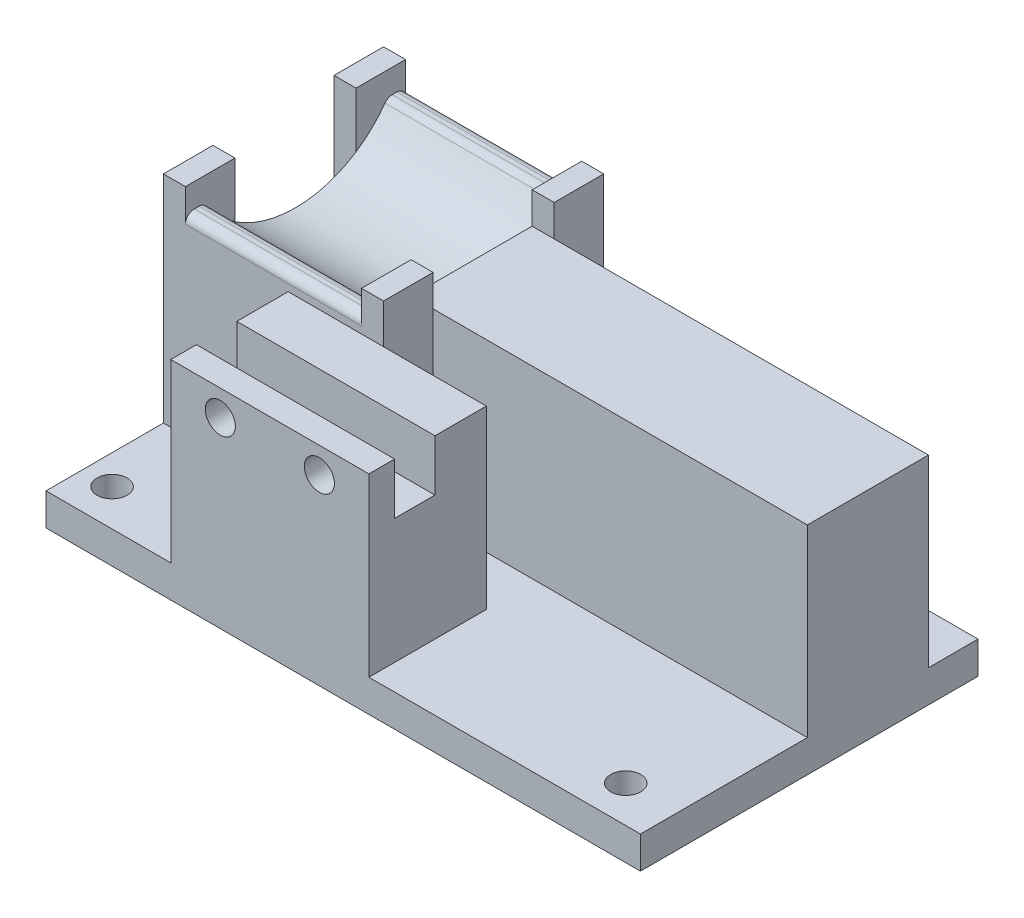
ISO-10303-21;
HEADER;
FILE_DESCRIPTION(('STEP AP214'),'2;1');
FILE_NAME('part.step','',(''),(''),'','','');
FILE_SCHEMA(('AUTOMOTIVE_DESIGN { 1 0 10303 214 1 1 1 1 }'));
ENDSEC;
DATA;
#1=APPLICATION_CONTEXT('core data for automotive mechanical design processes');
#2=APPLICATION_PROTOCOL_DEFINITION('international standard','automotive_design',2000,#1);
#3=PRODUCT_CONTEXT('',#1,'mechanical');
#4=PRODUCT('Part','Part','',(#3));
#5=PRODUCT_RELATED_PRODUCT_CATEGORY('part','',(#4));
#6=PRODUCT_DEFINITION_FORMATION('','',#4);
#7=PRODUCT_DEFINITION_CONTEXT('part definition',#1,'design');
#8=PRODUCT_DEFINITION('design','',#6,#7);
#9=PRODUCT_DEFINITION_SHAPE('','',#8);
#10=(LENGTH_UNIT() NAMED_UNIT(*) SI_UNIT(.MILLI.,.METRE.));
#11=(NAMED_UNIT(*) PLANE_ANGLE_UNIT() SI_UNIT($,.RADIAN.));
#12=(NAMED_UNIT(*) SI_UNIT($,.STERADIAN.) SOLID_ANGLE_UNIT());
#13=UNCERTAINTY_MEASURE_WITH_UNIT(LENGTH_MEASURE(1.E-05),#10,'distance_accuracy_value','');
#14=(GEOMETRIC_REPRESENTATION_CONTEXT(3) GLOBAL_UNCERTAINTY_ASSIGNED_CONTEXT((#13)) GLOBAL_UNIT_ASSIGNED_CONTEXT((#10,
#11,#12)) REPRESENTATION_CONTEXT('',''));
#15=CARTESIAN_POINT('',(0.,0.,0.));
#16=DIRECTION('',(0.,0.,1.));
#17=DIRECTION('',(1.,0.,0.));
#18=AXIS2_PLACEMENT_3D('',#15,#16,#17);
#19=CARTESIAN_POINT('',(0.,4.39,0.));
#20=DIRECTION('',(0.,1.,0.));
#21=DIRECTION('',(0.,0.,1.));
#22=AXIS2_PLACEMENT_3D('',#19,#20,#21);
#23=PLANE('',#22);
#24=CARTESIAN_POINT('',(33.5,4.39,18.));
#25=DIRECTION('',(0.,1.,0.));
#26=DIRECTION('',(0.,0.,1.));
#27=AXIS2_PLACEMENT_3D('',#24,#25,#26);
#28=CIRCLE('',#27,2.04999999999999);
#29=CARTESIAN_POINT('',(33.5,4.39,20.05));
#30=VERTEX_POINT('',#29);
#31=EDGE_CURVE('E307',#30,#30,#28,.T.);
#32=ORIENTED_EDGE('',*,*,#31,.F.);
#33=EDGE_LOOP('',(#32));
#34=FACE_BOUND('',#33,.T.);
#35=DIRECTION('',(0.,0.,-1.));
#36=VECTOR('',#35,1.);
#37=CARTESIAN_POINT('',(40.5,4.39,23.));
#38=LINE('',#37,#36);
#39=CARTESIAN_POINT('',(40.5,4.39,23.));
#40=VERTEX_POINT('',#39);
#41=CARTESIAN_POINT('',(40.5,4.39,0.250000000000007));
#42=VERTEX_POINT('',#41);
#43=EDGE_CURVE('E526',#40,#42,#38,.T.);
#44=ORIENTED_EDGE('',*,*,#43,.T.);
#45=DIRECTION('',(1.,0.,0.));
#46=VECTOR('',#45,1.);
#47=CARTESIAN_POINT('',(-13.5,4.39,0.250000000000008));
#48=LINE('',#47,#46);
#49=CARTESIAN_POINT('',(-10.5,4.39,0.250000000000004));
#50=VERTEX_POINT('',#49);
#51=EDGE_CURVE('E304',#50,#42,#48,.T.);
#52=ORIENTED_EDGE('',*,*,#51,.F.);
#53=DIRECTION('',(0.,0.,-1.));
#54=VECTOR('',#53,1.);
#55=CARTESIAN_POINT('',(-10.5,4.39,-23.));
#56=LINE('',#55,#54);
#57=CARTESIAN_POINT('',(-10.5,4.39,7.00000000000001));
#58=VERTEX_POINT('',#57);
#59=EDGE_CURVE('E506',#58,#50,#56,.T.);
#60=ORIENTED_EDGE('',*,*,#59,.F.);
#61=DIRECTION('',(-1.,0.,0.));
#62=VECTOR('',#61,1.);
#63=CARTESIAN_POINT('',(-23.5,4.39,7.00000000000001));
#64=LINE('',#63,#62);
#65=CARTESIAN_POINT('',(3.5,4.39,7.00000000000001));
#66=VERTEX_POINT('',#65);
#67=EDGE_CURVE('E394',#66,#58,#64,.T.);
#68=ORIENTED_EDGE('',*,*,#67,.F.);
#69=DIRECTION('',(0.,0.,-1.));
#70=VECTOR('',#69,1.);
#71=CARTESIAN_POINT('',(3.5,4.39,7.00000000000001));
#72=LINE('',#71,#70);
#73=CARTESIAN_POINT('',(3.5,4.39,23.));
#74=VERTEX_POINT('',#73);
#75=EDGE_CURVE('E392',#74,#66,#72,.T.);
#76=ORIENTED_EDGE('',*,*,#75,.F.);
#77=DIRECTION('',(1.,0.,0.));
#78=VECTOR('',#77,1.);
#79=CARTESIAN_POINT('',(40.5,4.39,23.));
#80=LINE('',#79,#78);
#81=EDGE_CURVE('E520',#74,#40,#80,.T.);
#82=ORIENTED_EDGE('',*,*,#81,.T.);
#83=EDGE_LOOP('',(#44,#52,#60,#68,#76,#82));
#84=FACE_BOUND('',#83,.T.);
#85=ADVANCED_FACE('F46',(#34,#84),#23,.T.);
#86=CARTESIAN_POINT('',(-10.5,4.39,-16.25));
#87=VERTEX_POINT('',#86);
#88=CARTESIAN_POINT('',(-10.5,4.39,-23.));
#89=VERTEX_POINT('',#88);
#90=EDGE_CURVE('E505',#87,#89,#56,.T.);
#91=ORIENTED_EDGE('',*,*,#90,.F.);
#92=DIRECTION('',(-1.,0.,0.));
#93=VECTOR('',#92,1.);
#94=CARTESIAN_POINT('',(-13.5,4.39,-16.25));
#95=LINE('',#94,#93);
#96=CARTESIAN_POINT('',(40.5,4.39,-16.25));
#97=VERTEX_POINT('',#96);
#98=EDGE_CURVE('E322',#97,#87,#95,.T.);
#99=ORIENTED_EDGE('',*,*,#98,.F.);
#100=CARTESIAN_POINT('',(40.5,4.39,-23.));
#101=VERTEX_POINT('',#100);
#102=EDGE_CURVE('E525',#97,#101,#38,.T.);
#103=ORIENTED_EDGE('',*,*,#102,.T.);
#104=DIRECTION('',(-1.,0.,0.));
#105=VECTOR('',#104,1.);
#106=CARTESIAN_POINT('',(40.5,4.39,-23.));
#107=LINE('',#106,#105);
#108=EDGE_CURVE('E528',#101,#89,#107,.T.);
#109=ORIENTED_EDGE('',*,*,#108,.T.);
#110=EDGE_LOOP('',(#91,#99,#103,#109));
#111=FACE_BOUND('',#110,.T.);
#112=ADVANCED_FACE('F666',(#111),#23,.T.);
#113=CARTESIAN_POINT('',(-13.5,38.79,-16.25));
#114=DIRECTION('',(0.,0.,-1.));
#115=DIRECTION('',(0.,1.,0.));
#116=AXIS2_PLACEMENT_3D('',#113,#114,#115);
#117=PLANE('',#116);
#118=DIRECTION('',(-1.,0.,0.));
#119=VECTOR('',#118,1.);
#120=CARTESIAN_POINT('',(-13.5,29.49,-16.25));
#121=LINE('',#120,#119);
#122=CARTESIAN_POINT('',(-10.5,29.49,-16.25));
#123=VERTEX_POINT('',#122);
#124=CARTESIAN_POINT('',(-13.5,29.49,-16.25));
#125=VERTEX_POINT('',#124);
#126=EDGE_CURVE('E314',#123,#125,#121,.T.);
#127=ORIENTED_EDGE('',*,*,#126,.F.);
#128=DIRECTION('',(0.,1.,0.));
#129=VECTOR('',#128,1.);
#130=CARTESIAN_POINT('',(-10.5,38.79,-16.25));
#131=LINE('',#130,#129);
#132=CARTESIAN_POINT('',(-10.5,33.79,-16.25));
#133=VERTEX_POINT('',#132);
#134=EDGE_CURVE('E468',#123,#133,#131,.T.);
#135=ORIENTED_EDGE('',*,*,#134,.T.);
#136=DIRECTION('',(1.,0.,0.));
#137=VECTOR('',#136,1.);
#138=CARTESIAN_POINT('',(-10.5,33.79,-16.25));
#139=LINE('',#138,#137);
#140=CARTESIAN_POINT('',(-13.5,33.79,-16.25));
#141=VERTEX_POINT('',#140);
#142=EDGE_CURVE('E457',#141,#133,#139,.T.);
#143=ORIENTED_EDGE('',*,*,#142,.F.);
#144=DIRECTION('',(0.,1.,0.));
#145=VECTOR('',#144,1.);
#146=CARTESIAN_POINT('',(-13.5,38.79,-16.25));
#147=LINE('',#146,#145);
#148=EDGE_CURVE('E550',#125,#141,#147,.T.);
#149=ORIENTED_EDGE('',*,*,#148,.F.);
#150=EDGE_LOOP('',(#127,#135,#143,#149));
#151=FACE_BOUND('',#150,.T.);
#152=ADVANCED_FACE('F655',(#151),#117,.F.);
#153=CARTESIAN_POINT('',(-13.5,38.79,0.25000000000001));
#154=DIRECTION('',(0.,0.,1.));
#155=DIRECTION('',(0.,-1.,0.));
#156=AXIS2_PLACEMENT_3D('',#153,#154,#155);
#157=PLANE('',#156);
#158=DIRECTION('',(1.,0.,0.));
#159=VECTOR('',#158,1.);
#160=CARTESIAN_POINT('',(-13.5,29.49,0.250000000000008));
#161=LINE('',#160,#159);
#162=CARTESIAN_POINT('',(-13.5,29.49,0.250000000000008));
#163=VERTEX_POINT('',#162);
#164=CARTESIAN_POINT('',(-10.5,29.49,0.250000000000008));
#165=VERTEX_POINT('',#164);
#166=EDGE_CURVE('E295',#163,#165,#161,.T.);
#167=ORIENTED_EDGE('',*,*,#166,.F.);
#168=DIRECTION('',(0.,-1.,0.));
#169=VECTOR('',#168,1.);
#170=CARTESIAN_POINT('',(-13.5,38.79,0.25000000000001));
#171=LINE('',#170,#169);
#172=CARTESIAN_POINT('',(-13.5,33.79,0.25000000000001));
#173=VERTEX_POINT('',#172);
#174=EDGE_CURVE('E469',#173,#163,#171,.T.);
#175=ORIENTED_EDGE('',*,*,#174,.F.);
#176=DIRECTION('',(-1.,0.,0.));
#177=VECTOR('',#176,1.);
#178=CARTESIAN_POINT('',(-13.5,33.79,0.25000000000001));
#179=LINE('',#178,#177);
#180=CARTESIAN_POINT('',(-10.5,33.79,0.250000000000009));
#181=VERTEX_POINT('',#180);
#182=EDGE_CURVE('E466',#181,#173,#179,.T.);
#183=ORIENTED_EDGE('',*,*,#182,.F.);
#184=DIRECTION('',(0.,-1.,0.));
#185=VECTOR('',#184,1.);
#186=CARTESIAN_POINT('',(-10.5,38.79,0.25000000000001));
#187=LINE('',#186,#185);
#188=EDGE_CURVE('E473',#181,#165,#187,.T.);
#189=ORIENTED_EDGE('',*,*,#188,.T.);
#190=EDGE_LOOP('',(#167,#175,#183,#189));
#191=FACE_BOUND('',#190,.T.);
#192=ADVANCED_FACE('F651',(#191),#157,.F.);
#193=CARTESIAN_POINT('',(0.,28.39,0.));
#194=DIRECTION('',(0.,1.,0.));
#195=DIRECTION('',(0.,0.,1.));
#196=AXIS2_PLACEMENT_3D('',#193,#194,#195);
#197=PLANE('',#196);
#198=DIRECTION('',(-1.,0.,0.));
#199=VECTOR('',#198,1.);
#200=CARTESIAN_POINT('',(-23.5,28.39,14.));
#201=LINE('',#200,#199);
#202=CARTESIAN_POINT('',(3.5,28.39,14.));
#203=VERTEX_POINT('',#202);
#204=CARTESIAN_POINT('',(-23.5,28.39,14.));
#205=VERTEX_POINT('',#204);
#206=EDGE_CURVE('E354',#203,#205,#201,.T.);
#207=ORIENTED_EDGE('',*,*,#206,.F.);
#208=DIRECTION('',(0.,0.,-1.));
#209=VECTOR('',#208,1.);
#210=CARTESIAN_POINT('',(3.5,28.39,7.00000000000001));
#211=LINE('',#210,#209);
#212=CARTESIAN_POINT('',(3.5,28.39,7.00000000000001));
#213=VERTEX_POINT('',#212);
#214=EDGE_CURVE('E381',#203,#213,#211,.T.);
#215=ORIENTED_EDGE('',*,*,#214,.T.);
#216=DIRECTION('',(-1.,0.,0.));
#217=VECTOR('',#216,1.);
#218=CARTESIAN_POINT('',(-23.5,28.39,7.00000000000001));
#219=LINE('',#218,#217);
#220=CARTESIAN_POINT('',(-10.5,28.39,7.00000000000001));
#221=VERTEX_POINT('',#220);
#222=EDGE_CURVE('E386',#213,#221,#219,.T.);
#223=ORIENTED_EDGE('',*,*,#222,.T.);
#224=CARTESIAN_POINT('',(-23.5,28.39,7.00000000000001));
#225=VERTEX_POINT('',#224);
#226=EDGE_CURVE('E385',#221,#225,#219,.T.);
#227=ORIENTED_EDGE('',*,*,#226,.T.);
#228=DIRECTION('',(0.,0.,1.));
#229=VECTOR('',#228,1.);
#230=CARTESIAN_POINT('',(-23.5,28.39,7.00000000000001));
#231=LINE('',#230,#229);
#232=EDGE_CURVE('E375',#225,#205,#231,.T.);
#233=ORIENTED_EDGE('',*,*,#232,.T.);
#234=EDGE_LOOP('',(#207,#215,#223,#227,#233));
#235=FACE_BOUND('',#234,.T.);
#236=ADVANCED_FACE('F714',(#235),#197,.T.);
#237=CARTESIAN_POINT('',(-36.5,4.39,18.));
#238=DIRECTION('',(0.,1.,0.));
#239=DIRECTION('',(0.,0.,1.));
#240=AXIS2_PLACEMENT_3D('',#237,#238,#239);
#241=CIRCLE('',#240,2.05);
#242=CARTESIAN_POINT('',(-36.5,4.39,20.05));
#243=VERTEX_POINT('',#242);
#244=EDGE_CURVE('E331',#243,#243,#241,.T.);
#245=ORIENTED_EDGE('',*,*,#244,.F.);
#246=EDGE_LOOP('',(#245));
#247=FACE_BOUND('',#246,.T.);
#248=CARTESIAN_POINT('',(-40.5,4.39,23.));
#249=VERTEX_POINT('',#248);
#250=CARTESIAN_POINT('',(-23.5,4.39,23.));
#251=VERTEX_POINT('',#250);
#252=EDGE_CURVE('E522',#249,#251,#80,.T.);
#253=ORIENTED_EDGE('',*,*,#252,.T.);
#254=DIRECTION('',(0.,0.,1.));
#255=VECTOR('',#254,1.);
#256=CARTESIAN_POINT('',(-23.5,4.39,7.00000000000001));
#257=LINE('',#256,#255);
#258=CARTESIAN_POINT('',(-23.5,4.39,7.00000000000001));
#259=VERTEX_POINT('',#258);
#260=EDGE_CURVE('E368',#259,#251,#257,.T.);
#261=ORIENTED_EDGE('',*,*,#260,.F.);
#262=DIRECTION('',(1.,0.,0.));
#263=VECTOR('',#262,1.);
#264=CARTESIAN_POINT('',(-40.5,4.39,7.00000000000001));
#265=LINE('',#264,#263);
#266=CARTESIAN_POINT('',(-40.5,4.39,7.00000000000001));
#267=VERTEX_POINT('',#266);
#268=EDGE_CURVE('E499',#267,#259,#265,.T.);
#269=ORIENTED_EDGE('',*,*,#268,.F.);
#270=DIRECTION('',(0.,0.,1.));
#271=VECTOR('',#270,1.);
#272=CARTESIAN_POINT('',(-40.5,4.39,23.));
#273=LINE('',#272,#271);
#274=EDGE_CURVE('E518',#267,#249,#273,.T.);
#275=ORIENTED_EDGE('',*,*,#274,.T.);
#276=EDGE_LOOP('',(#253,#261,#269,#275));
#277=FACE_BOUND('',#276,.T.);
#278=ADVANCED_FACE('F705',(#247,#277),#23,.T.);
#279=CARTESIAN_POINT('',(-40.5,38.79,7.00000000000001));
#280=DIRECTION('',(0.,0.,-1.));
#281=DIRECTION('',(-1.,0.,0.));
#282=AXIS2_PLACEMENT_3D('',#279,#280,#281);
#283=PLANE('',#282);
#284=DIRECTION('',(0.,1.,0.));
#285=VECTOR('',#284,1.);
#286=CARTESIAN_POINT('',(-13.5,38.79,7.00000000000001));
#287=LINE('',#286,#285);
#288=CARTESIAN_POINT('',(-13.5,29.3469027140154,7.00000000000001));
#289=VERTEX_POINT('',#288);
#290=CARTESIAN_POINT('',(-13.5,33.79,7.00000000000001));
#291=VERTEX_POINT('',#290);
#292=EDGE_CURVE('E487',#289,#291,#287,.T.);
#293=ORIENTED_EDGE('',*,*,#292,.F.);
#294=DIRECTION('',(1.,0.,0.));
#295=VECTOR('',#294,1.);
#296=CARTESIAN_POINT('',(-40.5,29.3469027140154,7.00000000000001));
#297=LINE('',#296,#295);
#298=CARTESIAN_POINT('',(-37.5,29.3469027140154,7.00000000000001));
#299=VERTEX_POINT('',#298);
#300=EDGE_CURVE('E580',#289,#299,#297,.F.);
#301=ORIENTED_EDGE('',*,*,#300,.T.);
#302=DIRECTION('',(0.,-1.,0.));
#303=VECTOR('',#302,1.);
#304=CARTESIAN_POINT('',(-37.5,38.79,7.00000000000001));
#305=LINE('',#304,#303);
#306=CARTESIAN_POINT('',(-37.5,33.79,7.00000000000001));
#307=VERTEX_POINT('',#306);
#308=EDGE_CURVE('E472',#307,#299,#305,.T.);
#309=ORIENTED_EDGE('',*,*,#308,.F.);
#310=DIRECTION('',(-1.,0.,0.));
#311=VECTOR('',#310,1.);
#312=CARTESIAN_POINT('',(-37.5,33.79,7.00000000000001));
#313=LINE('',#312,#311);
#314=CARTESIAN_POINT('',(-40.5,33.79,7.));
#315=VERTEX_POINT('',#314);
#316=EDGE_CURVE('E425',#307,#315,#313,.T.);
#317=ORIENTED_EDGE('',*,*,#316,.T.);
#318=DIRECTION('',(0.,-1.,0.));
#319=VECTOR('',#318,1.);
#320=CARTESIAN_POINT('',(-40.5,38.79,7.00000000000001));
#321=LINE('',#320,#319);
#322=EDGE_CURVE('E515',#315,#267,#321,.T.);
#323=ORIENTED_EDGE('',*,*,#322,.T.);
#324=ORIENTED_EDGE('',*,*,#268,.T.);
#325=DIRECTION('',(0.,-1.,0.));
#326=VECTOR('',#325,1.);
#327=CARTESIAN_POINT('',(-23.5,28.39,7.00000000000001));
#328=LINE('',#327,#326);
#329=EDGE_CURVE('E389',#225,#259,#328,.T.);
#330=ORIENTED_EDGE('',*,*,#329,.F.);
#331=ORIENTED_EDGE('',*,*,#226,.F.);
#332=DIRECTION('',(0.,-1.,0.));
#333=VECTOR('',#332,1.);
#334=CARTESIAN_POINT('',(-10.5,38.79,7.00000000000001));
#335=LINE('',#334,#333);
#336=CARTESIAN_POINT('',(-10.5,33.79,7.00000000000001));
#337=VERTEX_POINT('',#336);
#338=EDGE_CURVE('E512',#337,#221,#335,.T.);
#339=ORIENTED_EDGE('',*,*,#338,.F.);
#340=DIRECTION('',(1.,0.,0.));
#341=VECTOR('',#340,1.);
#342=CARTESIAN_POINT('',(-13.5,33.79,7.00000000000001));
#343=LINE('',#342,#341);
#344=EDGE_CURVE('E462',#291,#337,#343,.T.);
#345=ORIENTED_EDGE('',*,*,#344,.F.);
#346=EDGE_LOOP('',(#293,#301,#309,#317,#323,#324,#330,#331,#339,#345));
#347=FACE_BOUND('',#346,.T.);
#348=ADVANCED_FACE('F630',(#347),#283,.F.);
#349=CARTESIAN_POINT('',(-40.5,4.39,23.));
#350=DIRECTION('',(1.,0.,0.));
#351=DIRECTION('',(0.,0.,-1.));
#352=AXIS2_PLACEMENT_3D('',#349,#350,#351);
#353=PLANE('',#352);
#354=DIRECTION('',(0.,0.,-1.));
#355=VECTOR('',#354,1.);
#356=CARTESIAN_POINT('',(-40.5,33.79,-16.25));
#357=LINE('',#356,#355);
#358=CARTESIAN_POINT('',(-40.5,33.79,-16.25));
#359=VERTEX_POINT('',#358);
#360=CARTESIAN_POINT('',(-40.5,33.79,-23.));
#361=VERTEX_POINT('',#360);
#362=EDGE_CURVE('E404',#359,#361,#357,.T.);
#363=ORIENTED_EDGE('',*,*,#362,.T.);
#364=DIRECTION('',(0.,-1.,0.));
#365=VECTOR('',#364,1.);
#366=CARTESIAN_POINT('',(-40.5,4.39,-23.));
#367=LINE('',#366,#365);
#368=CARTESIAN_POINT('',(-40.5,0.,-23.));
#369=VERTEX_POINT('',#368);
#370=EDGE_CURVE('E531',#361,#369,#367,.T.);
#371=ORIENTED_EDGE('',*,*,#370,.T.);
#372=DIRECTION('',(0.,0.,1.));
#373=VECTOR('',#372,1.);
#374=CARTESIAN_POINT('',(-40.5,0.,23.));
#375=LINE('',#374,#373);
#376=CARTESIAN_POINT('',(-40.5,0.,23.));
#377=VERTEX_POINT('',#376);
#378=EDGE_CURVE('E517',#369,#377,#375,.T.);
#379=ORIENTED_EDGE('',*,*,#378,.T.);
#380=DIRECTION('',(0.,-1.,0.));
#381=VECTOR('',#380,1.);
#382=CARTESIAN_POINT('',(-40.5,4.39,23.));
#383=LINE('',#382,#381);
#384=EDGE_CURVE('E547',#249,#377,#383,.T.);
#385=ORIENTED_EDGE('',*,*,#384,.F.);
#386=ORIENTED_EDGE('',*,*,#274,.F.);
#387=ORIENTED_EDGE('',*,*,#322,.F.);
#388=DIRECTION('',(0.,0.,-1.));
#389=VECTOR('',#388,1.);
#390=CARTESIAN_POINT('',(-40.5,33.79,7.));
#391=LINE('',#390,#389);
#392=CARTESIAN_POINT('',(-40.5,33.79,0.250000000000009));
#393=VERTEX_POINT('',#392);
#394=EDGE_CURVE('E422',#315,#393,#391,.T.);
#395=ORIENTED_EDGE('',*,*,#394,.T.);
#396=DIRECTION('',(0.,-1.,0.));
#397=VECTOR('',#396,1.);
#398=CARTESIAN_POINT('',(-40.5,38.79,0.250000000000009));
#399=LINE('',#398,#397);
#400=CARTESIAN_POINT('',(-40.5,4.39,0.250000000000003));
#401=VERTEX_POINT('',#400);
#402=EDGE_CURVE('E433',#393,#401,#399,.T.);
#403=ORIENTED_EDGE('',*,*,#402,.T.);
#404=DIRECTION('',(0.,0.,-1.));
#405=VECTOR('',#404,1.);
#406=CARTESIAN_POINT('',(-40.5,4.39,0.250000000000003));
#407=LINE('',#406,#405);
#408=CARTESIAN_POINT('',(-40.5,4.39,-16.25));
#409=VERTEX_POINT('',#408);
#410=EDGE_CURVE('E442',#401,#409,#407,.T.);
#411=ORIENTED_EDGE('',*,*,#410,.T.);
#412=DIRECTION('',(0.,1.,0.));
#413=VECTOR('',#412,1.);
#414=CARTESIAN_POINT('',(-40.5,38.79,-16.25));
#415=LINE('',#414,#413);
#416=EDGE_CURVE('E428',#409,#359,#415,.T.);
#417=ORIENTED_EDGE('',*,*,#416,.T.);
#418=EDGE_LOOP('',(#363,#371,#379,#385,#386,#387,#395,#403,#411,#417));
#419=FACE_BOUND('',#418,.T.);
#420=ADVANCED_FACE('F623',(#419),#353,.F.);
#421=CARTESIAN_POINT('',(-37.5,38.79,-7.99999999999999));
#422=DIRECTION('',(1.,0.,0.));
#423=DIRECTION('',(0.,0.,-1.));
#424=AXIS2_PLACEMENT_3D('',#421,#422,#423);
#425=PLANE('',#424);
#426=DIRECTION('',(0.,1.,0.));
#427=VECTOR('',#426,1.);
#428=CARTESIAN_POINT('',(-37.5,38.79,-23.));
#429=LINE('',#428,#427);
#430=CARTESIAN_POINT('',(-37.5,29.3469027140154,-23.));
#431=VERTEX_POINT('',#430);
#432=CARTESIAN_POINT('',(-37.5,33.79,-23.));
#433=VERTEX_POINT('',#432);
#434=EDGE_CURVE('E481',#431,#433,#429,.T.);
#435=ORIENTED_EDGE('',*,*,#434,.T.);
#436=DIRECTION('',(0.,0.,1.));
#437=VECTOR('',#436,1.);
#438=CARTESIAN_POINT('',(-37.5,33.79,-16.25));
#439=LINE('',#438,#437);
#440=CARTESIAN_POINT('',(-37.5,33.79,-16.25));
#441=VERTEX_POINT('',#440);
#442=EDGE_CURVE('E410',#433,#441,#439,.T.);
#443=ORIENTED_EDGE('',*,*,#442,.T.);
#444=DIRECTION('',(0.,-1.,0.));
#445=VECTOR('',#444,1.);
#446=CARTESIAN_POINT('',(-37.5,38.79,-16.25));
#447=LINE('',#446,#445);
#448=CARTESIAN_POINT('',(-37.5,26.2625301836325,-16.25));
#449=VERTEX_POINT('',#448);
#450=EDGE_CURVE('E552',#441,#449,#447,.T.);
#451=ORIENTED_EDGE('',*,*,#450,.T.);
#452=CARTESIAN_POINT('',(-37.5,38.79,-7.99999999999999));
#453=DIRECTION('',(1.,0.,0.));
#454=DIRECTION('',(0.,0.,-1.));
#455=AXIS2_PLACEMENT_3D('',#452,#453,#454);
#456=CIRCLE('',#455,15.);
#457=CARTESIAN_POINT('',(-37.5,30.0463914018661,-20.1880805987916));
#458=VERTEX_POINT('',#457);
#459=EDGE_CURVE('E501',#449,#458,#456,.T.);
#460=ORIENTED_EDGE('',*,*,#459,.T.);
#461=CARTESIAN_POINT('',(-37.5,29.3469027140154,-21.1631270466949));
#462=DIRECTION('',(1.,0.,0.));
#463=DIRECTION('',(0.,0.,-1.));
#464=AXIS2_PLACEMENT_3D('',#461,#462,#463);
#465=CIRCLE('',#464,1.2);
#466=CARTESIAN_POINT('',(-37.5,30.5469027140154,-21.1631270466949));
#467=VERTEX_POINT('',#466);
#468=EDGE_CURVE('E570',#458,#467,#465,.F.);
#469=ORIENTED_EDGE('',*,*,#468,.T.);
#470=DIRECTION('',(0.,0.,1.));
#471=VECTOR('',#470,1.);
#472=CARTESIAN_POINT('',(-37.5,30.5469027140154,-48.3761433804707));
#473=LINE('',#472,#471);
#474=CARTESIAN_POINT('',(-37.5,30.5469027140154,-21.8));
#475=VERTEX_POINT('',#474);
#476=EDGE_CURVE('E494',#475,#467,#473,.T.);
#477=ORIENTED_EDGE('',*,*,#476,.F.);
#478=CARTESIAN_POINT('',(-37.5,29.3469027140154,-21.8));
#479=DIRECTION('',(1.,0.,0.));
#480=DIRECTION('',(0.,0.,-1.));
#481=AXIS2_PLACEMENT_3D('',#478,#479,#480);
#482=CIRCLE('',#481,1.2);
#483=EDGE_CURVE('E565',#475,#431,#482,.F.);
#484=ORIENTED_EDGE('',*,*,#483,.T.);
#485=EDGE_LOOP('',(#435,#443,#451,#460,#469,#477,#484));
#486=FACE_BOUND('',#485,.T.);
#487=ADVANCED_FACE('F689',(#486),#425,.T.);
#488=CARTESIAN_POINT('',(40.5,4.39,-23.));
#489=DIRECTION('',(0.,0.,1.));
#490=DIRECTION('',(1.,0.,0.));
#491=AXIS2_PLACEMENT_3D('',#488,#489,#490);
#492=PLANE('',#491);
#493=ORIENTED_EDGE('',*,*,#434,.F.);
#494=DIRECTION('',(-1.,0.,0.));
#495=VECTOR('',#494,1.);
#496=CARTESIAN_POINT('',(40.5,29.3469027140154,-23.));
#497=LINE('',#496,#495);
#498=CARTESIAN_POINT('',(-13.5,29.3469027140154,-23.));
#499=VERTEX_POINT('',#498);
#500=EDGE_CURVE('E559',#431,#499,#497,.F.);
#501=ORIENTED_EDGE('',*,*,#500,.T.);
#502=DIRECTION('',(0.,-1.,0.));
#503=VECTOR('',#502,1.);
#504=CARTESIAN_POINT('',(-13.5,38.79,-23.));
#505=LINE('',#504,#503);
#506=CARTESIAN_POINT('',(-13.5,33.79,-23.));
#507=VERTEX_POINT('',#506);
#508=EDGE_CURVE('E479',#507,#499,#505,.T.);
#509=ORIENTED_EDGE('',*,*,#508,.F.);
#510=DIRECTION('',(-1.,0.,0.));
#511=VECTOR('',#510,1.);
#512=CARTESIAN_POINT('',(-10.5,33.79,-23.));
#513=LINE('',#512,#511);
#514=CARTESIAN_POINT('',(-10.5,33.79,-23.));
#515=VERTEX_POINT('',#514);
#516=EDGE_CURVE('E452',#515,#507,#513,.T.);
#517=ORIENTED_EDGE('',*,*,#516,.F.);
#518=DIRECTION('',(0.,-1.,0.));
#519=VECTOR('',#518,1.);
#520=CARTESIAN_POINT('',(-10.5,38.79,-23.));
#521=LINE('',#520,#519);
#522=EDGE_CURVE('E509',#515,#89,#521,.T.);
#523=ORIENTED_EDGE('',*,*,#522,.T.);
#524=ORIENTED_EDGE('',*,*,#108,.F.);
#525=DIRECTION('',(0.,-1.,0.));
#526=VECTOR('',#525,1.);
#527=CARTESIAN_POINT('',(40.5,4.39,-23.));
#528=LINE('',#527,#526);
#529=CARTESIAN_POINT('',(40.5,0.,-23.));
#530=VERTEX_POINT('',#529);
#531=EDGE_CURVE('E541',#101,#530,#528,.T.);
#532=ORIENTED_EDGE('',*,*,#531,.T.);
#533=DIRECTION('',(-1.,0.,0.));
#534=VECTOR('',#533,1.);
#535=CARTESIAN_POINT('',(40.5,0.,-23.));
#536=LINE('',#535,#534);
#537=EDGE_CURVE('E521',#530,#369,#536,.T.);
#538=ORIENTED_EDGE('',*,*,#537,.T.);
#539=ORIENTED_EDGE('',*,*,#370,.F.);
#540=DIRECTION('',(1.,0.,0.));
#541=VECTOR('',#540,1.);
#542=CARTESIAN_POINT('',(-40.5,33.79,-23.));
#543=LINE('',#542,#541);
#544=EDGE_CURVE('E413',#361,#433,#543,.T.);
#545=ORIENTED_EDGE('',*,*,#544,.T.);
#546=EDGE_LOOP('',(#493,#501,#509,#517,#523,#524,#532,#538,#539,#545));
#547=FACE_BOUND('',#546,.T.);
#548=ADVANCED_FACE('F672',(#547),#492,.F.);
#549=CARTESIAN_POINT('',(-37.5,38.79,-16.25));
#550=DIRECTION('',(0.,0.,1.));
#551=DIRECTION('',(0.,-1.,0.));
#552=AXIS2_PLACEMENT_3D('',#549,#550,#551);
#553=PLANE('',#552);
#554=ORIENTED_EDGE('',*,*,#450,.F.);
#555=DIRECTION('',(-1.,0.,0.));
#556=VECTOR('',#555,1.);
#557=CARTESIAN_POINT('',(-40.5,33.79,-16.25));
#558=LINE('',#557,#556);
#559=EDGE_CURVE('E407',#441,#359,#558,.T.);
#560=ORIENTED_EDGE('',*,*,#559,.T.);
#561=ORIENTED_EDGE('',*,*,#416,.F.);
#562=DIRECTION('',(-1.,0.,0.));
#563=VECTOR('',#562,1.);
#564=CARTESIAN_POINT('',(-37.5,4.39,-16.25));
#565=LINE('',#564,#563);
#566=CARTESIAN_POINT('',(-37.5,4.39,-16.25));
#567=VERTEX_POINT('',#566);
#568=EDGE_CURVE('E439',#567,#409,#565,.T.);
#569=ORIENTED_EDGE('',*,*,#568,.F.);
#570=DIRECTION('',(0.,1.,0.));
#571=VECTOR('',#570,1.);
#572=CARTESIAN_POINT('',(-37.5,38.79,-16.25));
#573=LINE('',#572,#571);
#574=EDGE_CURVE('E429',#567,#449,#573,.T.);
#575=ORIENTED_EDGE('',*,*,#574,.T.);
#576=EDGE_LOOP('',(#554,#560,#561,#569,#575));
#577=FACE_BOUND('',#576,.T.);
#578=ADVANCED_FACE('F621',(#577),#553,.T.);
#579=DIRECTION('',(0.,0.,1.));
#580=VECTOR('',#579,1.);
#581=CARTESIAN_POINT('',(-37.5,33.79,7.00000000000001));
#582=LINE('',#581,#580);
#583=CARTESIAN_POINT('',(-37.5,33.79,0.250000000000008));
#584=VERTEX_POINT('',#583);
#585=EDGE_CURVE('E416',#584,#307,#582,.T.);
#586=ORIENTED_EDGE('',*,*,#585,.T.);
#587=ORIENTED_EDGE('',*,*,#308,.T.);
#588=CARTESIAN_POINT('',(-37.5,29.3469027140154,5.80000000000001));
#589=DIRECTION('',(1.,0.,0.));
#590=DIRECTION('',(0.,0.,-1.));
#591=AXIS2_PLACEMENT_3D('',#588,#589,#590);
#592=CIRCLE('',#591,1.2);
#593=CARTESIAN_POINT('',(-37.5,30.5469027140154,5.80000000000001));
#594=VERTEX_POINT('',#593);
#595=EDGE_CURVE('E588',#299,#594,#592,.F.);
#596=ORIENTED_EDGE('',*,*,#595,.T.);
#597=CARTESIAN_POINT('',(-37.5,30.5469027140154,5.16312704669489));
#598=VERTEX_POINT('',#597);
#599=EDGE_CURVE('E490',#598,#594,#473,.T.);
#600=ORIENTED_EDGE('',*,*,#599,.F.);
#601=CARTESIAN_POINT('',(-37.5,29.3469027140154,5.16312704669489));
#602=DIRECTION('',(1.,0.,0.));
#603=DIRECTION('',(0.,0.,-1.));
#604=AXIS2_PLACEMENT_3D('',#601,#602,#603);
#605=CIRCLE('',#604,1.2);
#606=CARTESIAN_POINT('',(-37.5,30.0463914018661,4.18808059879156));
#607=VERTEX_POINT('',#606);
#608=EDGE_CURVE('E13',#598,#607,#605,.F.);
#609=ORIENTED_EDGE('',*,*,#608,.T.);
#610=CARTESIAN_POINT('',(-37.5,26.2625301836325,0.250000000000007));
#611=VERTEX_POINT('',#610);
#612=EDGE_CURVE('E497',#607,#611,#456,.T.);
#613=ORIENTED_EDGE('',*,*,#612,.T.);
#614=DIRECTION('',(0.,-1.,0.));
#615=VECTOR('',#614,1.);
#616=CARTESIAN_POINT('',(-37.5,38.79,0.250000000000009));
#617=LINE('',#616,#615);
#618=EDGE_CURVE('E436',#584,#611,#617,.T.);
#619=ORIENTED_EDGE('',*,*,#618,.F.);
#620=EDGE_LOOP('',(#586,#587,#596,#600,#609,#613,#619));
#621=FACE_BOUND('',#620,.T.);
#622=ADVANCED_FACE('F604',(#621),#425,.T.);
#623=CARTESIAN_POINT('',(-10.5,38.79,-23.));
#624=DIRECTION('',(-1.,0.,0.));
#625=DIRECTION('',(0.,0.,1.));
#626=AXIS2_PLACEMENT_3D('',#623,#624,#625);
#627=PLANE('',#626);
#628=DIRECTION('',(0.,0.,-1.));
#629=VECTOR('',#628,1.);
#630=CARTESIAN_POINT('',(-10.5,33.79,-16.25));
#631=LINE('',#630,#629);
#632=EDGE_CURVE('E449',#133,#515,#631,.T.);
#633=ORIENTED_EDGE('',*,*,#632,.F.);
#634=ORIENTED_EDGE('',*,*,#134,.F.);
#635=EDGE_CURVE('E474',#87,#123,#131,.T.);
#636=ORIENTED_EDGE('',*,*,#635,.F.);
#637=ORIENTED_EDGE('',*,*,#90,.T.);
#638=ORIENTED_EDGE('',*,*,#522,.F.);
#639=EDGE_LOOP('',(#633,#634,#636,#637,#638));
#640=FACE_BOUND('',#639,.T.);
#641=ADVANCED_FACE('F659',(#640),#627,.F.);
#642=CARTESIAN_POINT('',(40.5,4.39,23.));
#643=DIRECTION('',(0.,0.,-1.));
#644=DIRECTION('',(-1.,0.,0.));
#645=AXIS2_PLACEMENT_3D('',#642,#643,#644);
#646=PLANE('',#645);
#647=CARTESIAN_POINT('',(-16.75,24.89,23.));
#648=DIRECTION('',(0.,0.,1.));
#649=DIRECTION('',(1.,0.,0.));
#650=AXIS2_PLACEMENT_3D('',#647,#648,#649);
#651=CIRCLE('',#650,2.05);
#652=CARTESIAN_POINT('',(-14.7,24.89,23.));
#653=VERTEX_POINT('',#652);
#654=EDGE_CURVE('E337',#653,#653,#651,.T.);
#655=ORIENTED_EDGE('',*,*,#654,.F.);
#656=EDGE_LOOP('',(#655));
#657=FACE_BOUND('',#656,.T.);
#658=CARTESIAN_POINT('',(-3.25,24.89,23.));
#659=DIRECTION('',(0.,0.,1.));
#660=DIRECTION('',(1.,0.,0.));
#661=AXIS2_PLACEMENT_3D('',#658,#659,#660);
#662=CIRCLE('',#661,2.05);
#663=CARTESIAN_POINT('',(-1.2,24.89,23.));
#664=VERTEX_POINT('',#663);
#665=EDGE_CURVE('E343',#664,#664,#662,.T.);
#666=ORIENTED_EDGE('',*,*,#665,.F.);
#667=EDGE_LOOP('',(#666));
#668=FACE_BOUND('',#667,.T.);
#669=DIRECTION('',(1.,0.,0.));
#670=VECTOR('',#669,1.);
#671=CARTESIAN_POINT('',(40.5,0.,23.));
#672=LINE('',#671,#670);
#673=CARTESIAN_POINT('',(40.5,0.,23.));
#674=VERTEX_POINT('',#673);
#675=EDGE_CURVE('E534',#377,#674,#672,.T.);
#676=ORIENTED_EDGE('',*,*,#675,.T.);
#677=DIRECTION('',(0.,-1.,0.));
#678=VECTOR('',#677,1.);
#679=CARTESIAN_POINT('',(40.5,4.39,23.));
#680=LINE('',#679,#678);
#681=EDGE_CURVE('E544',#40,#674,#680,.T.);
#682=ORIENTED_EDGE('',*,*,#681,.F.);
#683=ORIENTED_EDGE('',*,*,#81,.F.);
#684=DIRECTION('',(0.,-1.,0.));
#685=VECTOR('',#684,1.);
#686=CARTESIAN_POINT('',(3.5,28.39,23.));
#687=LINE('',#686,#685);
#688=CARTESIAN_POINT('',(3.5,28.39,23.));
#689=VERTEX_POINT('',#688);
#690=EDGE_CURVE('E400',#689,#74,#687,.T.);
#691=ORIENTED_EDGE('',*,*,#690,.F.);
#692=DIRECTION('',(1.,0.,0.));
#693=VECTOR('',#692,1.);
#694=CARTESIAN_POINT('',(-23.5,28.39,23.));
#695=LINE('',#694,#693);
#696=CARTESIAN_POINT('',(-23.5,28.39,23.));
#697=VERTEX_POINT('',#696);
#698=EDGE_CURVE('E378',#697,#689,#695,.T.);
#699=ORIENTED_EDGE('',*,*,#698,.F.);
#700=DIRECTION('',(0.,-1.,0.));
#701=VECTOR('',#700,1.);
#702=CARTESIAN_POINT('',(-23.5,28.39,23.));
#703=LINE('',#702,#701);
#704=EDGE_CURVE('E402',#697,#251,#703,.T.);
#705=ORIENTED_EDGE('',*,*,#704,.T.);
#706=ORIENTED_EDGE('',*,*,#252,.F.);
#707=ORIENTED_EDGE('',*,*,#384,.T.);
#708=EDGE_LOOP('',(#676,#682,#683,#691,#699,#705,#706,#707));
#709=FACE_BOUND('',#708,.T.);
#710=ADVANCED_FACE('F729',(#657,#668,#709),#646,.F.);
#711=CARTESIAN_POINT('',(40.5,4.39,23.));
#712=DIRECTION('',(-1.,0.,0.));
#713=DIRECTION('',(0.,0.,1.));
#714=AXIS2_PLACEMENT_3D('',#711,#712,#713);
#715=PLANE('',#714);
#716=DIRECTION('',(0.,0.,-1.));
#717=VECTOR('',#716,1.);
#718=CARTESIAN_POINT('',(40.5,0.,23.));
#719=LINE('',#718,#717);
#720=EDGE_CURVE('E536',#674,#530,#719,.T.);
#721=ORIENTED_EDGE('',*,*,#720,.T.);
#722=ORIENTED_EDGE('',*,*,#531,.F.);
#723=ORIENTED_EDGE('',*,*,#102,.F.);
#724=DIRECTION('',(0.,-1.,0.));
#725=VECTOR('',#724,1.);
#726=CARTESIAN_POINT('',(40.5,29.49,-16.25));
#727=LINE('',#726,#725);
#728=CARTESIAN_POINT('',(40.5,29.49,-16.25));
#729=VERTEX_POINT('',#728);
#730=EDGE_CURVE('E308',#729,#97,#727,.T.);
#731=ORIENTED_EDGE('',*,*,#730,.F.);
#732=DIRECTION('',(0.,0.,-1.));
#733=VECTOR('',#732,1.);
#734=CARTESIAN_POINT('',(40.5,29.49,0.250000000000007));
#735=LINE('',#734,#733);
#736=CARTESIAN_POINT('',(40.5,29.49,0.250000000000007));
#737=VERTEX_POINT('',#736);
#738=EDGE_CURVE('E293',#737,#729,#735,.T.);
#739=ORIENTED_EDGE('',*,*,#738,.F.);
#740=DIRECTION('',(0.,-1.,0.));
#741=VECTOR('',#740,1.);
#742=CARTESIAN_POINT('',(40.5,29.49,0.250000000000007));
#743=LINE('',#742,#741);
#744=EDGE_CURVE('E302',#737,#42,#743,.T.);
#745=ORIENTED_EDGE('',*,*,#744,.T.);
#746=ORIENTED_EDGE('',*,*,#43,.F.);
#747=ORIENTED_EDGE('',*,*,#681,.T.);
#748=EDGE_LOOP('',(#721,#722,#723,#731,#739,#745,#746,#747));
#749=FACE_BOUND('',#748,.T.);
#750=ADVANCED_FACE('F310',(#749),#715,.F.);
#751=CARTESIAN_POINT('',(0.,0.,0.));
#752=DIRECTION('',(0.,1.,0.));
#753=DIRECTION('',(0.,0.,1.));
#754=AXIS2_PLACEMENT_3D('',#751,#752,#753);
#755=PLANE('',#754);
#756=CARTESIAN_POINT('',(33.5,0.,18.));
#757=DIRECTION('',(0.,1.,0.));
#758=DIRECTION('',(0.,0.,1.));
#759=AXIS2_PLACEMENT_3D('',#756,#757,#758);
#760=CIRCLE('',#759,2.04999999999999);
#761=CARTESIAN_POINT('',(33.5,0.,20.05));
#762=VERTEX_POINT('',#761);
#763=EDGE_CURVE('E328',#762,#762,#760,.F.);
#764=ORIENTED_EDGE('',*,*,#763,.F.);
#765=EDGE_LOOP('',(#764));
#766=FACE_BOUND('',#765,.T.);
#767=CARTESIAN_POINT('',(-36.5,0.,18.));
#768=DIRECTION('',(0.,1.,0.));
#769=DIRECTION('',(0.,0.,1.));
#770=AXIS2_PLACEMENT_3D('',#767,#768,#769);
#771=CIRCLE('',#770,2.05);
#772=CARTESIAN_POINT('',(-36.5,0.,20.05));
#773=VERTEX_POINT('',#772);
#774=EDGE_CURVE('E334',#773,#773,#771,.F.);
#775=ORIENTED_EDGE('',*,*,#774,.F.);
#776=EDGE_LOOP('',(#775));
#777=FACE_BOUND('',#776,.T.);
#778=ORIENTED_EDGE('',*,*,#378,.F.);
#779=ORIENTED_EDGE('',*,*,#537,.F.);
#780=ORIENTED_EDGE('',*,*,#720,.F.);
#781=ORIENTED_EDGE('',*,*,#675,.F.);
#782=EDGE_LOOP('',(#778,#779,#780,#781));
#783=FACE_BOUND('',#782,.T.);
#784=ADVANCED_FACE('F735',(#766,#777,#783),#755,.F.);
#785=ORIENTED_EDGE('',*,*,#188,.F.);
#786=DIRECTION('',(0.,0.,-1.));
#787=VECTOR('',#786,1.);
#788=CARTESIAN_POINT('',(-10.5,33.79,7.00000000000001));
#789=LINE('',#788,#787);
#790=EDGE_CURVE('E464',#337,#181,#789,.T.);
#791=ORIENTED_EDGE('',*,*,#790,.F.);
#792=ORIENTED_EDGE('',*,*,#338,.T.);
#793=EDGE_CURVE('E511',#221,#58,#335,.T.);
#794=ORIENTED_EDGE('',*,*,#793,.T.);
#795=ORIENTED_EDGE('',*,*,#59,.T.);
#796=EDGE_CURVE('E477',#165,#50,#187,.T.);
#797=ORIENTED_EDGE('',*,*,#796,.F.);
#798=EDGE_LOOP('',(#785,#791,#792,#794,#795,#797));
#799=FACE_BOUND('',#798,.T.);
#800=ADVANCED_FACE('F647',(#799),#627,.F.);
#801=CARTESIAN_POINT('',(-37.5,38.79,-7.99999999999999));
#802=DIRECTION('',(1.,0.,0.));
#803=DIRECTION('',(0.,0.,-1.));
#804=AXIS2_PLACEMENT_3D('',#801,#802,#803);
#805=CYLINDRICAL_SURFACE('',#804,15.);
#806=ORIENTED_EDGE('',*,*,#612,.F.);
#807=DIRECTION('',(1.,0.,0.));
#808=VECTOR('',#807,1.);
#809=CARTESIAN_POINT('',(-37.5,30.0463914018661,4.18808059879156));
#810=LINE('',#809,#808);
#811=CARTESIAN_POINT('',(-13.5,30.0463914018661,4.18808059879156));
#812=VERTEX_POINT('',#811);
#813=EDGE_CURVE('E583',#607,#812,#810,.T.);
#814=ORIENTED_EDGE('',*,*,#813,.T.);
#815=CARTESIAN_POINT('',(-13.5,38.79,-7.99999999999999));
#816=DIRECTION('',(1.,0.,0.));
#817=DIRECTION('',(0.,0.,-1.));
#818=AXIS2_PLACEMENT_3D('',#815,#816,#817);
#819=CIRCLE('',#818,15.);
#820=CARTESIAN_POINT('',(-13.5,30.0463914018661,-20.1880805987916));
#821=VERTEX_POINT('',#820);
#822=EDGE_CURVE('E485',#812,#821,#819,.T.);
#823=ORIENTED_EDGE('',*,*,#822,.T.);
#824=DIRECTION('',(1.,0.,0.));
#825=VECTOR('',#824,1.);
#826=CARTESIAN_POINT('',(-37.5,30.0463914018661,-20.1880805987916));
#827=LINE('',#826,#825);
#828=EDGE_CURVE('E562',#821,#458,#827,.F.);
#829=ORIENTED_EDGE('',*,*,#828,.T.);
#830=ORIENTED_EDGE('',*,*,#459,.F.);
#831=EDGE_CURVE('E500',#611,#449,#456,.T.);
#832=ORIENTED_EDGE('',*,*,#831,.F.);
#833=EDGE_LOOP('',(#806,#814,#823,#829,#830,#832));
#834=FACE_BOUND('',#833,.T.);
#835=ADVANCED_FACE('F599',(#834),#805,.F.);
#836=CARTESIAN_POINT('',(-13.5,38.79,-7.99999999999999));
#837=DIRECTION('',(1.,0.,0.));
#838=DIRECTION('',(0.,0.,-1.));
#839=AXIS2_PLACEMENT_3D('',#836,#837,#838);
#840=PLANE('',#839);
#841=ORIENTED_EDGE('',*,*,#292,.T.);
#842=DIRECTION('',(0.,0.,1.));
#843=VECTOR('',#842,1.);
#844=CARTESIAN_POINT('',(-13.5,33.79,7.00000000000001));
#845=LINE('',#844,#843);
#846=EDGE_CURVE('E460',#173,#291,#845,.T.);
#847=ORIENTED_EDGE('',*,*,#846,.F.);
#848=ORIENTED_EDGE('',*,*,#174,.T.);
#849=DIRECTION('',(0.,0.,1.));
#850=VECTOR('',#849,1.);
#851=CARTESIAN_POINT('',(-13.5,29.49,0.250000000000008));
#852=LINE('',#851,#850);
#853=EDGE_CURVE('E298',#125,#163,#852,.T.);
#854=ORIENTED_EDGE('',*,*,#853,.F.);
#855=ORIENTED_EDGE('',*,*,#148,.T.);
#856=DIRECTION('',(0.,0.,1.));
#857=VECTOR('',#856,1.);
#858=CARTESIAN_POINT('',(-13.5,33.79,-16.25));
#859=LINE('',#858,#857);
#860=EDGE_CURVE('E454',#507,#141,#859,.T.);
#861=ORIENTED_EDGE('',*,*,#860,.F.);
#862=ORIENTED_EDGE('',*,*,#508,.T.);
#863=CARTESIAN_POINT('',(-13.5,29.3469027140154,-21.8));
#864=DIRECTION('',(1.,0.,0.));
#865=DIRECTION('',(0.,0.,-1.));
#866=AXIS2_PLACEMENT_3D('',#863,#864,#865);
#867=CIRCLE('',#866,1.2);
#868=CARTESIAN_POINT('',(-13.5,30.5469027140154,-21.8));
#869=VERTEX_POINT('',#868);
#870=EDGE_CURVE('E568',#499,#869,#867,.T.);
#871=ORIENTED_EDGE('',*,*,#870,.T.);
#872=DIRECTION('',(0.,0.,1.));
#873=VECTOR('',#872,1.);
#874=CARTESIAN_POINT('',(-13.5,30.5469027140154,-48.3761433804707));
#875=LINE('',#874,#873);
#876=CARTESIAN_POINT('',(-13.5,30.5469027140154,-21.1631270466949));
#877=VERTEX_POINT('',#876);
#878=EDGE_CURVE('E482',#869,#877,#875,.T.);
#879=ORIENTED_EDGE('',*,*,#878,.T.);
#880=CARTESIAN_POINT('',(-13.5,29.3469027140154,-21.1631270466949));
#881=DIRECTION('',(1.,0.,0.));
#882=DIRECTION('',(0.,0.,-1.));
#883=AXIS2_PLACEMENT_3D('',#880,#881,#882);
#884=CIRCLE('',#883,1.2);
#885=EDGE_CURVE('E572',#877,#821,#884,.T.);
#886=ORIENTED_EDGE('',*,*,#885,.T.);
#887=ORIENTED_EDGE('',*,*,#822,.F.);
#888=CARTESIAN_POINT('',(-13.5,29.3469027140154,5.16312704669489));
#889=DIRECTION('',(1.,0.,0.));
#890=DIRECTION('',(0.,0.,-1.));
#891=AXIS2_PLACEMENT_3D('',#888,#889,#890);
#892=CIRCLE('',#891,1.2);
#893=CARTESIAN_POINT('',(-13.5,30.5469027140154,5.16312704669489));
#894=VERTEX_POINT('',#893);
#895=EDGE_CURVE('E54',#812,#894,#892,.T.);
#896=ORIENTED_EDGE('',*,*,#895,.T.);
#897=CARTESIAN_POINT('',(-13.5,30.5469027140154,5.80000000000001));
#898=VERTEX_POINT('',#897);
#899=EDGE_CURVE('E493',#894,#898,#875,.T.);
#900=ORIENTED_EDGE('',*,*,#899,.T.);
#901=CARTESIAN_POINT('',(-13.5,29.3469027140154,5.80000000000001));
#902=DIRECTION('',(1.,0.,0.));
#903=DIRECTION('',(0.,0.,-1.));
#904=AXIS2_PLACEMENT_3D('',#901,#902,#903);
#905=CIRCLE('',#904,1.2);
#906=EDGE_CURVE('E585',#898,#289,#905,.T.);
#907=ORIENTED_EDGE('',*,*,#906,.T.);
#908=EDGE_LOOP('',(#841,#847,#848,#854,#855,#861,#862,#871,#879,#886,#887,#896,#900,#907));
#909=FACE_BOUND('',#908,.T.);
#910=ADVANCED_FACE('F593',(#909),#840,.F.);
#911=CARTESIAN_POINT('',(-37.5,30.5469027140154,-48.3761433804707));
#912=DIRECTION('',(0.,-1.,0.));
#913=DIRECTION('',(0.,0.,-1.));
#914=AXIS2_PLACEMENT_3D('',#911,#912,#913);
#915=PLANE('',#914);
#916=ORIENTED_EDGE('',*,*,#599,.T.);
#917=DIRECTION('',(1.,0.,0.));
#918=VECTOR('',#917,1.);
#919=CARTESIAN_POINT('',(-37.5,30.5469027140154,5.80000000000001));
#920=LINE('',#919,#918);
#921=EDGE_CURVE('E577',#594,#898,#920,.T.);
#922=ORIENTED_EDGE('',*,*,#921,.T.);
#923=ORIENTED_EDGE('',*,*,#899,.F.);
#924=DIRECTION('',(1.,0.,0.));
#925=VECTOR('',#924,1.);
#926=CARTESIAN_POINT('',(-37.5,30.5469027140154,5.16312704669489));
#927=LINE('',#926,#925);
#928=EDGE_CURVE('E575',#894,#598,#927,.F.);
#929=ORIENTED_EDGE('',*,*,#928,.T.);
#930=EDGE_LOOP('',(#916,#922,#923,#929));
#931=FACE_BOUND('',#930,.T.);
#932=ADVANCED_FACE('F596',(#931),#915,.F.);
#933=ORIENTED_EDGE('',*,*,#878,.F.);
#934=DIRECTION('',(-1.,0.,0.));
#935=VECTOR('',#934,1.);
#936=CARTESIAN_POINT('',(-37.5,30.5469027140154,-21.8));
#937=LINE('',#936,#935);
#938=EDGE_CURVE('E556',#869,#475,#937,.T.);
#939=ORIENTED_EDGE('',*,*,#938,.T.);
#940=ORIENTED_EDGE('',*,*,#476,.T.);
#941=DIRECTION('',(1.,0.,0.));
#942=VECTOR('',#941,1.);
#943=CARTESIAN_POINT('',(-37.5,30.5469027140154,-21.1631270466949));
#944=LINE('',#943,#942);
#945=EDGE_CURVE('E554',#467,#877,#944,.T.);
#946=ORIENTED_EDGE('',*,*,#945,.T.);
#947=EDGE_LOOP('',(#933,#939,#940,#946));
#948=FACE_BOUND('',#947,.T.);
#949=ADVANCED_FACE('F686',(#948),#915,.F.);
#950=CARTESIAN_POINT('',(0.,33.79,0.));
#951=DIRECTION('',(0.,-1.,0.));
#952=DIRECTION('',(0.,0.,-1.));
#953=AXIS2_PLACEMENT_3D('',#950,#951,#952);
#954=PLANE('',#953);
#955=ORIENTED_EDGE('',*,*,#846,.T.);
#956=ORIENTED_EDGE('',*,*,#344,.T.);
#957=ORIENTED_EDGE('',*,*,#790,.T.);
#958=ORIENTED_EDGE('',*,*,#182,.T.);
#959=EDGE_LOOP('',(#955,#956,#957,#958));
#960=FACE_BOUND('',#959,.T.);
#961=ADVANCED_FACE('F643',(#960),#954,.F.);
#962=CARTESIAN_POINT('',(0.,33.79,0.));
#963=DIRECTION('',(0.,1.,0.));
#964=DIRECTION('',(0.,0.,1.));
#965=AXIS2_PLACEMENT_3D('',#962,#963,#964);
#966=PLANE('',#965);
#967=ORIENTED_EDGE('',*,*,#632,.T.);
#968=ORIENTED_EDGE('',*,*,#516,.T.);
#969=ORIENTED_EDGE('',*,*,#860,.T.);
#970=ORIENTED_EDGE('',*,*,#142,.T.);
#971=EDGE_LOOP('',(#967,#968,#969,#970));
#972=FACE_BOUND('',#971,.T.);
#973=ADVANCED_FACE('F677',(#972),#966,.T.);
#974=CARTESIAN_POINT('',(-37.5,0.,0.));
#975=DIRECTION('',(-1.,0.,0.));
#976=DIRECTION('',(0.,0.,-1.));
#977=AXIS2_PLACEMENT_3D('',#974,#975,#976);
#978=PLANE('',#977);
#979=ORIENTED_EDGE('',*,*,#831,.T.);
#980=ORIENTED_EDGE('',*,*,#574,.F.);
#981=DIRECTION('',(0.,0.,-1.));
#982=VECTOR('',#981,1.);
#983=CARTESIAN_POINT('',(-37.5,4.39,0.250000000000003));
#984=LINE('',#983,#982);
#985=CARTESIAN_POINT('',(-37.5,4.39,0.250000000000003));
#986=VERTEX_POINT('',#985);
#987=EDGE_CURVE('E432',#986,#567,#984,.T.);
#988=ORIENTED_EDGE('',*,*,#987,.F.);
#989=EDGE_CURVE('E435',#611,#986,#617,.T.);
#990=ORIENTED_EDGE('',*,*,#989,.F.);
#991=EDGE_LOOP('',(#979,#980,#988,#990));
#992=FACE_BOUND('',#991,.T.);
#993=ADVANCED_FACE('F612',(#992),#978,.T.);
#994=CARTESIAN_POINT('',(-37.5,38.79,0.250000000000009));
#995=DIRECTION('',(0.,0.,-1.));
#996=DIRECTION('',(0.,1.,0.));
#997=AXIS2_PLACEMENT_3D('',#994,#995,#996);
#998=PLANE('',#997);
#999=DIRECTION('',(1.,0.,0.));
#1000=VECTOR('',#999,1.);
#1001=CARTESIAN_POINT('',(-37.5,33.79,0.250000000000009));
#1002=LINE('',#1001,#1000);
#1003=EDGE_CURVE('E419',#393,#584,#1002,.T.);
#1004=ORIENTED_EDGE('',*,*,#1003,.T.);
#1005=ORIENTED_EDGE('',*,*,#618,.T.);
#1006=ORIENTED_EDGE('',*,*,#989,.T.);
#1007=DIRECTION('',(-1.,0.,0.));
#1008=VECTOR('',#1007,1.);
#1009=CARTESIAN_POINT('',(-37.5,4.39,0.250000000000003));
#1010=LINE('',#1009,#1008);
#1011=EDGE_CURVE('E446',#986,#401,#1010,.T.);
#1012=ORIENTED_EDGE('',*,*,#1011,.T.);
#1013=ORIENTED_EDGE('',*,*,#402,.F.);
#1014=EDGE_LOOP('',(#1004,#1005,#1006,#1012,#1013));
#1015=FACE_BOUND('',#1014,.T.);
#1016=ADVANCED_FACE('F607',(#1015),#998,.T.);
#1017=CARTESIAN_POINT('',(-37.5,4.39,0.250000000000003));
#1018=DIRECTION('',(0.,1.,0.));
#1019=DIRECTION('',(0.,0.,1.));
#1020=AXIS2_PLACEMENT_3D('',#1017,#1018,#1019);
#1021=PLANE('',#1020);
#1022=ORIENTED_EDGE('',*,*,#410,.F.);
#1023=ORIENTED_EDGE('',*,*,#1011,.F.);
#1024=ORIENTED_EDGE('',*,*,#987,.T.);
#1025=ORIENTED_EDGE('',*,*,#568,.T.);
#1026=EDGE_LOOP('',(#1022,#1023,#1024,#1025));
#1027=FACE_BOUND('',#1026,.T.);
#1028=ADVANCED_FACE('F617',(#1027),#1021,.T.);
#1029=CARTESIAN_POINT('',(-51.,33.79,0.));
#1030=DIRECTION('',(0.,-1.,0.));
#1031=DIRECTION('',(0.,0.,-1.));
#1032=AXIS2_PLACEMENT_3D('',#1029,#1030,#1031);
#1033=PLANE('',#1032);
#1034=ORIENTED_EDGE('',*,*,#585,.F.);
#1035=ORIENTED_EDGE('',*,*,#1003,.F.);
#1036=ORIENTED_EDGE('',*,*,#394,.F.);
#1037=ORIENTED_EDGE('',*,*,#316,.F.);
#1038=EDGE_LOOP('',(#1034,#1035,#1036,#1037));
#1039=FACE_BOUND('',#1038,.T.);
#1040=ADVANCED_FACE('F627',(#1039),#1033,.F.);
#1041=CARTESIAN_POINT('',(-51.,33.79,0.));
#1042=DIRECTION('',(0.,1.,0.));
#1043=DIRECTION('',(0.,0.,1.));
#1044=AXIS2_PLACEMENT_3D('',#1041,#1042,#1043);
#1045=PLANE('',#1044);
#1046=ORIENTED_EDGE('',*,*,#362,.F.);
#1047=ORIENTED_EDGE('',*,*,#559,.F.);
#1048=ORIENTED_EDGE('',*,*,#442,.F.);
#1049=ORIENTED_EDGE('',*,*,#544,.F.);
#1050=EDGE_LOOP('',(#1046,#1047,#1048,#1049));
#1051=FACE_BOUND('',#1050,.T.);
#1052=ADVANCED_FACE('F785',(#1051),#1045,.T.);
#1053=CARTESIAN_POINT('',(-23.5,28.39,7.00000000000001));
#1054=DIRECTION('',(0.,0.,1.));
#1055=DIRECTION('',(1.,0.,0.));
#1056=AXIS2_PLACEMENT_3D('',#1053,#1054,#1055);
#1057=PLANE('',#1056);
#1058=ORIENTED_EDGE('',*,*,#67,.T.);
#1059=ORIENTED_EDGE('',*,*,#793,.F.);
#1060=ORIENTED_EDGE('',*,*,#222,.F.);
#1061=DIRECTION('',(0.,-1.,0.));
#1062=VECTOR('',#1061,1.);
#1063=CARTESIAN_POINT('',(3.5,28.39,7.00000000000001));
#1064=LINE('',#1063,#1062);
#1065=EDGE_CURVE('E397',#213,#66,#1064,.T.);
#1066=ORIENTED_EDGE('',*,*,#1065,.T.);
#1067=EDGE_LOOP('',(#1058,#1059,#1060,#1066));
#1068=FACE_BOUND('',#1067,.T.);
#1069=ADVANCED_FACE('F760',(#1068),#1057,.F.);
#1070=CARTESIAN_POINT('',(-23.5,28.39,7.00000000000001));
#1071=DIRECTION('',(1.,0.,0.));
#1072=DIRECTION('',(0.,0.,-1.));
#1073=AXIS2_PLACEMENT_3D('',#1070,#1071,#1072);
#1074=PLANE('',#1073);
#1075=DIRECTION('',(0.,0.,1.));
#1076=VECTOR('',#1075,1.);
#1077=CARTESIAN_POINT('',(-23.5,21.39,14.));
#1078=LINE('',#1077,#1076);
#1079=CARTESIAN_POINT('',(-23.5,21.39,14.));
#1080=VERTEX_POINT('',#1079);
#1081=CARTESIAN_POINT('',(-23.5,21.39,19.5));
#1082=VERTEX_POINT('',#1081);
#1083=EDGE_CURVE('E350',#1080,#1082,#1078,.T.);
#1084=ORIENTED_EDGE('',*,*,#1083,.F.);
#1085=DIRECTION('',(0.,1.,0.));
#1086=VECTOR('',#1085,1.);
#1087=CARTESIAN_POINT('',(-23.5,21.39,14.));
#1088=LINE('',#1087,#1086);
#1089=EDGE_CURVE('E365',#1080,#205,#1088,.T.);
#1090=ORIENTED_EDGE('',*,*,#1089,.T.);
#1091=ORIENTED_EDGE('',*,*,#232,.F.);
#1092=ORIENTED_EDGE('',*,*,#329,.T.);
#1093=ORIENTED_EDGE('',*,*,#260,.T.);
#1094=ORIENTED_EDGE('',*,*,#704,.F.);
#1095=CARTESIAN_POINT('',(-23.5,28.39,19.5));
#1096=VERTEX_POINT('',#1095);
#1097=EDGE_CURVE('E379',#1096,#697,#231,.T.);
#1098=ORIENTED_EDGE('',*,*,#1097,.F.);
#1099=DIRECTION('',(0.,1.,0.));
#1100=VECTOR('',#1099,1.);
#1101=CARTESIAN_POINT('',(-23.5,21.39,19.5));
#1102=LINE('',#1101,#1100);
#1103=EDGE_CURVE('E362',#1082,#1096,#1102,.T.);
#1104=ORIENTED_EDGE('',*,*,#1103,.F.);
#1105=EDGE_LOOP('',(#1084,#1090,#1091,#1092,#1093,#1094,#1098,#1104));
#1106=FACE_BOUND('',#1105,.T.);
#1107=ADVANCED_FACE('F753',(#1106),#1074,.F.);
#1108=CARTESIAN_POINT('',(3.5,28.39,7.00000000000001));
#1109=DIRECTION('',(-1.,0.,0.));
#1110=DIRECTION('',(0.,0.,1.));
#1111=AXIS2_PLACEMENT_3D('',#1108,#1109,#1110);
#1112=PLANE('',#1111);
#1113=ORIENTED_EDGE('',*,*,#214,.F.);
#1114=DIRECTION('',(0.,1.,0.));
#1115=VECTOR('',#1114,1.);
#1116=CARTESIAN_POINT('',(3.5,21.39,14.));
#1117=LINE('',#1116,#1115);
#1118=CARTESIAN_POINT('',(3.5,21.39,14.));
#1119=VERTEX_POINT('',#1118);
#1120=EDGE_CURVE('E369',#1119,#203,#1117,.T.);
#1121=ORIENTED_EDGE('',*,*,#1120,.F.);
#1122=DIRECTION('',(0.,0.,-1.));
#1123=VECTOR('',#1122,1.);
#1124=CARTESIAN_POINT('',(3.5,21.39,14.));
#1125=LINE('',#1124,#1123);
#1126=CARTESIAN_POINT('',(3.5,21.39,19.5));
#1127=VERTEX_POINT('',#1126);
#1128=EDGE_CURVE('E357',#1127,#1119,#1125,.T.);
#1129=ORIENTED_EDGE('',*,*,#1128,.F.);
#1130=DIRECTION('',(0.,1.,0.));
#1131=VECTOR('',#1130,1.);
#1132=CARTESIAN_POINT('',(3.5,21.39,19.5));
#1133=LINE('',#1132,#1131);
#1134=CARTESIAN_POINT('',(3.5,28.39,19.5));
#1135=VERTEX_POINT('',#1134);
#1136=EDGE_CURVE('E371',#1127,#1135,#1133,.T.);
#1137=ORIENTED_EDGE('',*,*,#1136,.T.);
#1138=EDGE_CURVE('E382',#689,#1135,#211,.T.);
#1139=ORIENTED_EDGE('',*,*,#1138,.F.);
#1140=ORIENTED_EDGE('',*,*,#690,.T.);
#1141=ORIENTED_EDGE('',*,*,#75,.T.);
#1142=ORIENTED_EDGE('',*,*,#1065,.F.);
#1143=EDGE_LOOP('',(#1113,#1121,#1129,#1137,#1139,#1140,#1141,#1142));
#1144=FACE_BOUND('',#1143,.T.);
#1145=ADVANCED_FACE('F745',(#1144),#1112,.F.);
#1146=DIRECTION('',(1.,0.,0.));
#1147=VECTOR('',#1146,1.);
#1148=CARTESIAN_POINT('',(-23.5,28.39,19.5));
#1149=LINE('',#1148,#1147);
#1150=EDGE_CURVE('E349',#1096,#1135,#1149,.T.);
#1151=ORIENTED_EDGE('',*,*,#1150,.F.);
#1152=ORIENTED_EDGE('',*,*,#1097,.T.);
#1153=ORIENTED_EDGE('',*,*,#698,.T.);
#1154=ORIENTED_EDGE('',*,*,#1138,.T.);
#1155=EDGE_LOOP('',(#1151,#1152,#1153,#1154));
#1156=FACE_BOUND('',#1155,.T.);
#1157=ADVANCED_FACE('F722',(#1156),#197,.T.);
#1158=CARTESIAN_POINT('',(-23.5,21.39,14.));
#1159=DIRECTION('',(0.,0.,-1.));
#1160=DIRECTION('',(-1.,0.,0.));
#1161=AXIS2_PLACEMENT_3D('',#1158,#1159,#1160);
#1162=PLANE('',#1161);
#1163=ORIENTED_EDGE('',*,*,#206,.T.);
#1164=ORIENTED_EDGE('',*,*,#1089,.F.);
#1165=DIRECTION('',(-1.,0.,0.));
#1166=VECTOR('',#1165,1.);
#1167=CARTESIAN_POINT('',(-23.5,21.39,14.));
#1168=LINE('',#1167,#1166);
#1169=EDGE_CURVE('E359',#1119,#1080,#1168,.T.);
#1170=ORIENTED_EDGE('',*,*,#1169,.F.);
#1171=ORIENTED_EDGE('',*,*,#1120,.T.);
#1172=EDGE_LOOP('',(#1163,#1164,#1170,#1171));
#1173=FACE_BOUND('',#1172,.T.);
#1174=ADVANCED_FACE('F764',(#1173),#1162,.F.);
#1175=CARTESIAN_POINT('',(-23.5,21.39,19.5));
#1176=DIRECTION('',(0.,0.,1.));
#1177=DIRECTION('',(1.,0.,0.));
#1178=AXIS2_PLACEMENT_3D('',#1175,#1176,#1177);
#1179=PLANE('',#1178);
#1180=CARTESIAN_POINT('',(-16.75,24.89,19.5));
#1181=DIRECTION('',(0.,0.,1.));
#1182=DIRECTION('',(1.,0.,0.));
#1183=AXIS2_PLACEMENT_3D('',#1180,#1181,#1182);
#1184=CIRCLE('',#1183,2.05);
#1185=CARTESIAN_POINT('',(-14.7,24.89,19.5));
#1186=VERTEX_POINT('',#1185);
#1187=EDGE_CURVE('E340',#1186,#1186,#1184,.F.);
#1188=ORIENTED_EDGE('',*,*,#1187,.F.);
#1189=EDGE_LOOP('',(#1188));
#1190=FACE_BOUND('',#1189,.T.);
#1191=CARTESIAN_POINT('',(-3.25,24.89,19.5));
#1192=DIRECTION('',(0.,0.,1.));
#1193=DIRECTION('',(1.,0.,0.));
#1194=AXIS2_PLACEMENT_3D('',#1191,#1192,#1193);
#1195=CIRCLE('',#1194,2.05);
#1196=CARTESIAN_POINT('',(-1.2,24.89,19.5));
#1197=VERTEX_POINT('',#1196);
#1198=EDGE_CURVE('E346',#1197,#1197,#1195,.F.);
#1199=ORIENTED_EDGE('',*,*,#1198,.F.);
#1200=EDGE_LOOP('',(#1199));
#1201=FACE_BOUND('',#1200,.T.);
#1202=ORIENTED_EDGE('',*,*,#1150,.T.);
#1203=ORIENTED_EDGE('',*,*,#1136,.F.);
#1204=DIRECTION('',(1.,0.,0.));
#1205=VECTOR('',#1204,1.);
#1206=CARTESIAN_POINT('',(-23.5,21.39,19.5));
#1207=LINE('',#1206,#1205);
#1208=EDGE_CURVE('E353',#1082,#1127,#1207,.T.);
#1209=ORIENTED_EDGE('',*,*,#1208,.F.);
#1210=ORIENTED_EDGE('',*,*,#1103,.T.);
#1211=EDGE_LOOP('',(#1202,#1203,#1209,#1210));
#1212=FACE_BOUND('',#1211,.T.);
#1213=ADVANCED_FACE('F768',(#1190,#1201,#1212),#1179,.F.);
#1214=CARTESIAN_POINT('',(0.,21.39,0.));
#1215=DIRECTION('',(0.,1.,0.));
#1216=DIRECTION('',(0.,0.,1.));
#1217=AXIS2_PLACEMENT_3D('',#1214,#1215,#1216);
#1218=PLANE('',#1217);
#1219=ORIENTED_EDGE('',*,*,#1083,.T.);
#1220=ORIENTED_EDGE('',*,*,#1208,.T.);
#1221=ORIENTED_EDGE('',*,*,#1128,.T.);
#1222=ORIENTED_EDGE('',*,*,#1169,.T.);
#1223=EDGE_LOOP('',(#1219,#1220,#1221,#1222));
#1224=FACE_BOUND('',#1223,.T.);
#1225=ADVANCED_FACE('F766',(#1224),#1218,.T.);
#1226=CARTESIAN_POINT('',(-3.25,24.89,13.7017243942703));
#1227=DIRECTION('',(0.,0.,1.));
#1228=DIRECTION('',(1.,0.,0.));
#1229=AXIS2_PLACEMENT_3D('',#1226,#1227,#1228);
#1230=CYLINDRICAL_SURFACE('',#1229,2.05);
#1231=ORIENTED_EDGE('',*,*,#1198,.T.);
#1232=EDGE_LOOP('',(#1231));
#1233=FACE_BOUND('',#1232,.T.);
#1234=ORIENTED_EDGE('',*,*,#665,.T.);
#1235=EDGE_LOOP('',(#1234));
#1236=FACE_BOUND('',#1235,.T.);
#1237=ADVANCED_FACE('F776',(#1233,#1236),#1230,.F.);
#1238=CARTESIAN_POINT('',(-16.75,24.89,13.7017243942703));
#1239=DIRECTION('',(0.,0.,1.));
#1240=DIRECTION('',(1.,0.,0.));
#1241=AXIS2_PLACEMENT_3D('',#1238,#1239,#1240);
#1242=CYLINDRICAL_SURFACE('',#1241,2.05);
#1243=ORIENTED_EDGE('',*,*,#1187,.T.);
#1244=EDGE_LOOP('',(#1243));
#1245=FACE_BOUND('',#1244,.T.);
#1246=ORIENTED_EDGE('',*,*,#654,.T.);
#1247=EDGE_LOOP('',(#1246));
#1248=FACE_BOUND('',#1247,.T.);
#1249=ADVANCED_FACE('F964',(#1245,#1248),#1242,.F.);
#1250=CARTESIAN_POINT('',(-36.5,-0.00100000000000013,18.));
#1251=DIRECTION('',(0.,1.,0.));
#1252=DIRECTION('',(0.,0.,1.));
#1253=AXIS2_PLACEMENT_3D('',#1250,#1251,#1252);
#1254=CYLINDRICAL_SURFACE('',#1253,2.05);
#1255=ORIENTED_EDGE('',*,*,#244,.T.);
#1256=EDGE_LOOP('',(#1255));
#1257=FACE_BOUND('',#1256,.T.);
#1258=ORIENTED_EDGE('',*,*,#774,.T.);
#1259=EDGE_LOOP('',(#1258));
#1260=FACE_BOUND('',#1259,.T.);
#1261=ADVANCED_FACE('F973',(#1257,#1260),#1254,.F.);
#1262=CARTESIAN_POINT('',(33.5,-0.00100000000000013,18.));
#1263=DIRECTION('',(0.,1.,0.));
#1264=DIRECTION('',(0.,0.,1.));
#1265=AXIS2_PLACEMENT_3D('',#1262,#1263,#1264);
#1266=CYLINDRICAL_SURFACE('',#1265,2.04999999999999);
#1267=ORIENTED_EDGE('',*,*,#31,.T.);
#1268=EDGE_LOOP('',(#1267));
#1269=FACE_BOUND('',#1268,.T.);
#1270=ORIENTED_EDGE('',*,*,#763,.T.);
#1271=EDGE_LOOP('',(#1270));
#1272=FACE_BOUND('',#1271,.T.);
#1273=ADVANCED_FACE('F995',(#1269,#1272),#1266,.F.);
#1274=CARTESIAN_POINT('',(-13.5,29.49,0.250000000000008));
#1275=DIRECTION('',(0.,0.,-1.));
#1276=DIRECTION('',(-1.,0.,0.));
#1277=AXIS2_PLACEMENT_3D('',#1274,#1275,#1276);
#1278=PLANE('',#1277);
#1279=EDGE_CURVE('E287',#165,#737,#161,.T.);
#1280=ORIENTED_EDGE('',*,*,#1279,.F.);
#1281=ORIENTED_EDGE('',*,*,#796,.T.);
#1282=ORIENTED_EDGE('',*,*,#51,.T.);
#1283=ORIENTED_EDGE('',*,*,#744,.F.);
#1284=EDGE_LOOP('',(#1280,#1281,#1282,#1283));
#1285=FACE_BOUND('',#1284,.T.);
#1286=ADVANCED_FACE('F303',(#1285),#1278,.F.);
#1287=CARTESIAN_POINT('',(-13.5,29.49,-16.25));
#1288=DIRECTION('',(0.,0.,1.));
#1289=DIRECTION('',(1.,0.,0.));
#1290=AXIS2_PLACEMENT_3D('',#1287,#1288,#1289);
#1291=PLANE('',#1290);
#1292=ORIENTED_EDGE('',*,*,#98,.T.);
#1293=ORIENTED_EDGE('',*,*,#635,.T.);
#1294=EDGE_CURVE('E317',#729,#123,#121,.T.);
#1295=ORIENTED_EDGE('',*,*,#1294,.F.);
#1296=ORIENTED_EDGE('',*,*,#730,.T.);
#1297=EDGE_LOOP('',(#1292,#1293,#1295,#1296));
#1298=FACE_BOUND('',#1297,.T.);
#1299=ADVANCED_FACE('F664',(#1298),#1291,.F.);
#1300=CARTESIAN_POINT('',(0.,29.49,0.));
#1301=DIRECTION('',(0.,-1.,0.));
#1302=DIRECTION('',(0.,0.,-1.));
#1303=AXIS2_PLACEMENT_3D('',#1300,#1301,#1302);
#1304=PLANE('',#1303);
#1305=ORIENTED_EDGE('',*,*,#853,.T.);
#1306=ORIENTED_EDGE('',*,*,#166,.T.);
#1307=ORIENTED_EDGE('',*,*,#1279,.T.);
#1308=ORIENTED_EDGE('',*,*,#738,.T.);
#1309=ORIENTED_EDGE('',*,*,#1294,.T.);
#1310=ORIENTED_EDGE('',*,*,#126,.T.);
#1311=EDGE_LOOP('',(#1305,#1306,#1307,#1308,#1309,#1310));
#1312=FACE_BOUND('',#1311,.T.);
#1313=ADVANCED_FACE('F290',(#1312),#1304,.F.);
#1314=CARTESIAN_POINT('',(-37.5,29.3469027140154,-21.8));
#1315=DIRECTION('',(-1.,0.,0.));
#1316=DIRECTION('',(0.,0.,1.));
#1317=AXIS2_PLACEMENT_3D('',#1314,#1315,#1316);
#1318=CYLINDRICAL_SURFACE('',#1317,1.2);
#1319=ORIENTED_EDGE('',*,*,#870,.F.);
#1320=ORIENTED_EDGE('',*,*,#500,.F.);
#1321=ORIENTED_EDGE('',*,*,#483,.F.);
#1322=ORIENTED_EDGE('',*,*,#938,.F.);
#1323=EDGE_LOOP('',(#1319,#1320,#1321,#1322));
#1324=FACE_BOUND('',#1323,.T.);
#1325=ADVANCED_FACE('F683',(#1324),#1318,.T.);
#1326=CARTESIAN_POINT('',(-37.5,29.3469027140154,-21.1631270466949));
#1327=DIRECTION('',(1.,0.,0.));
#1328=DIRECTION('',(0.,0.,-1.));
#1329=AXIS2_PLACEMENT_3D('',#1326,#1327,#1328);
#1330=CYLINDRICAL_SURFACE('',#1329,1.2);
#1331=ORIENTED_EDGE('',*,*,#885,.F.);
#1332=ORIENTED_EDGE('',*,*,#945,.F.);
#1333=ORIENTED_EDGE('',*,*,#468,.F.);
#1334=ORIENTED_EDGE('',*,*,#828,.F.);
#1335=EDGE_LOOP('',(#1331,#1332,#1333,#1334));
#1336=FACE_BOUND('',#1335,.T.);
#1337=ADVANCED_FACE('F694',(#1336),#1330,.T.);
#1338=CARTESIAN_POINT('',(-37.5,29.3469027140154,5.80000000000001));
#1339=DIRECTION('',(1.,0.,0.));
#1340=DIRECTION('',(0.,0.,-1.));
#1341=AXIS2_PLACEMENT_3D('',#1338,#1339,#1340);
#1342=CYLINDRICAL_SURFACE('',#1341,1.2);
#1343=ORIENTED_EDGE('',*,*,#595,.F.);
#1344=ORIENTED_EDGE('',*,*,#300,.F.);
#1345=ORIENTED_EDGE('',*,*,#906,.F.);
#1346=ORIENTED_EDGE('',*,*,#921,.F.);
#1347=EDGE_LOOP('',(#1343,#1344,#1345,#1346));
#1348=FACE_BOUND('',#1347,.T.);
#1349=ADVANCED_FACE('F635',(#1348),#1342,.T.);
#1350=CARTESIAN_POINT('',(-37.5,29.3469027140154,5.16312704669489));
#1351=DIRECTION('',(1.,0.,0.));
#1352=DIRECTION('',(0.,0.,-1.));
#1353=AXIS2_PLACEMENT_3D('',#1350,#1351,#1352);
#1354=CYLINDRICAL_SURFACE('',#1353,1.2);
#1355=ORIENTED_EDGE('',*,*,#608,.F.);
#1356=ORIENTED_EDGE('',*,*,#928,.F.);
#1357=ORIENTED_EDGE('',*,*,#895,.F.);
#1358=ORIENTED_EDGE('',*,*,#813,.F.);
#1359=EDGE_LOOP('',(#1355,#1356,#1357,#1358));
#1360=FACE_BOUND('',#1359,.T.);
#1361=ADVANCED_FACE('F48',(#1360),#1354,.T.);
#1362=CLOSED_SHELL('',(#85,#112,#152,#192,#236,#278,#348,#420,#487,#548,#578,#622,#641,#710,
#750,#784,#800,#835,#910,#932,#949,#961,#973,#993,#1016,#1028,#1040,#1052,#1069,#1107,#1145,
#1157,#1174,#1213,#1225,#1237,#1249,#1261,#1273,#1286,#1299,#1313,#1325,#1337,#1349,#1361));
#1363=MANIFOLD_SOLID_BREP('B2',#1362);
#1364=ADVANCED_BREP_SHAPE_REPRESENTATION('',(#18,#1363),#14);
#1365=SHAPE_DEFINITION_REPRESENTATION(#9,#1364);
ENDSEC;
END-ISO-10303-21;
